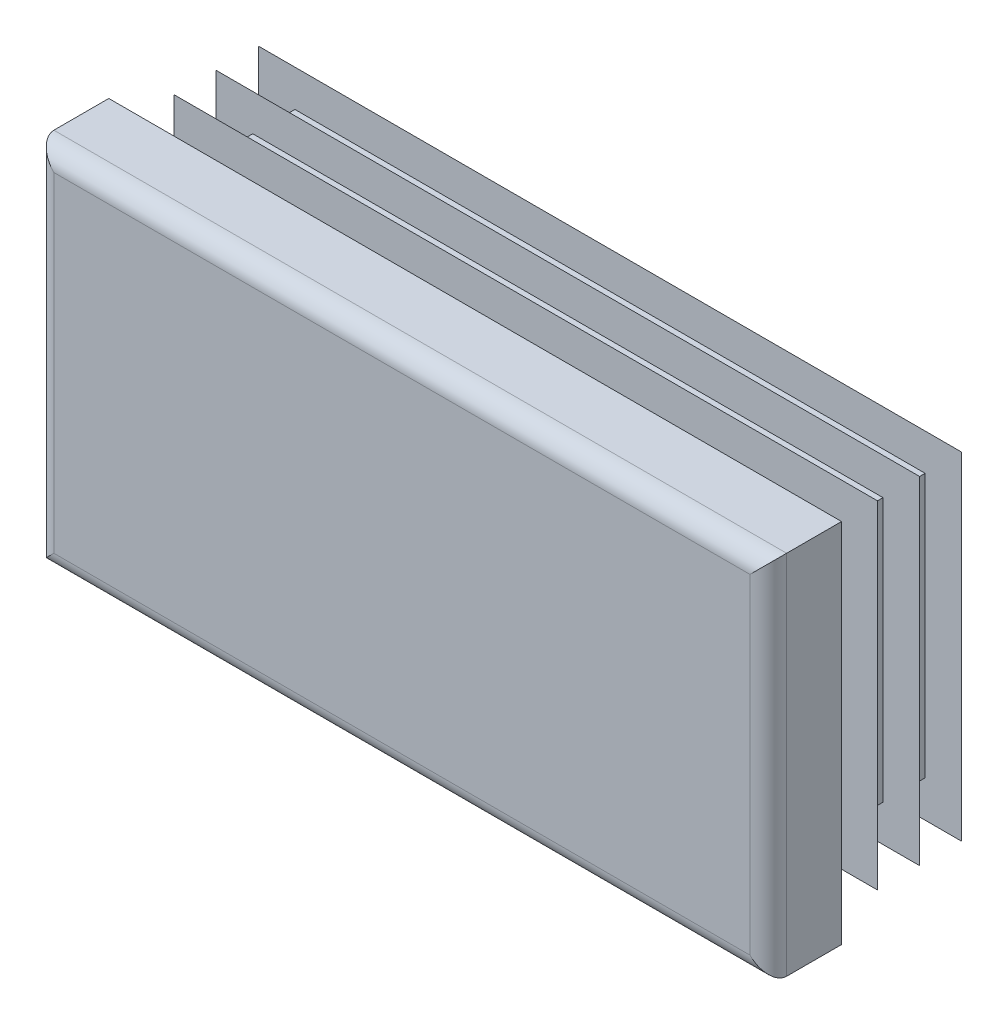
ISO-10303-21;
HEADER;
FILE_DESCRIPTION(('STEP AP214'),'2;1');
FILE_NAME('part.step','',(''),(''),'','','');
FILE_SCHEMA(('AUTOMOTIVE_DESIGN { 1 0 10303 214 1 1 1 1 }'));
ENDSEC;
DATA;
#1=APPLICATION_CONTEXT('core data for automotive mechanical design processes');
#2=APPLICATION_PROTOCOL_DEFINITION('international standard','automotive_design',2000,#1);
#3=PRODUCT_CONTEXT('',#1,'mechanical');
#4=PRODUCT('Part','Part','',(#3));
#5=PRODUCT_RELATED_PRODUCT_CATEGORY('part','',(#4));
#6=PRODUCT_DEFINITION_FORMATION('','',#4);
#7=PRODUCT_DEFINITION_CONTEXT('part definition',#1,'design');
#8=PRODUCT_DEFINITION('design','',#6,#7);
#9=PRODUCT_DEFINITION_SHAPE('','',#8);
#10=(LENGTH_UNIT() NAMED_UNIT(*) SI_UNIT(.MILLI.,.METRE.));
#11=(NAMED_UNIT(*) PLANE_ANGLE_UNIT() SI_UNIT($,.RADIAN.));
#12=(NAMED_UNIT(*) SI_UNIT($,.STERADIAN.) SOLID_ANGLE_UNIT());
#13=UNCERTAINTY_MEASURE_WITH_UNIT(LENGTH_MEASURE(1.E-05),#10,'distance_accuracy_value','');
#14=(GEOMETRIC_REPRESENTATION_CONTEXT(3) GLOBAL_UNCERTAINTY_ASSIGNED_CONTEXT((#13)) GLOBAL_UNIT_ASSIGNED_CONTEXT((#10,
#11,#12)) REPRESENTATION_CONTEXT('',''));
#15=CARTESIAN_POINT('',(0.,0.,0.));
#16=DIRECTION('',(0.,0.,1.));
#17=DIRECTION('',(1.,0.,0.));
#18=AXIS2_PLACEMENT_3D('',#15,#16,#17);
#19=CARTESIAN_POINT('',(23.75,-12.5,5.));
#20=DIRECTION('',(0.,0.,-1.));
#21=DIRECTION('',(0.,1.,0.));
#22=AXIS2_PLACEMENT_3D('',#19,#20,#21);
#23=PLANE('',#22);
#24=DIRECTION('',(0.,1.,0.));
#25=VECTOR('',#24,1.);
#26=CARTESIAN_POINT('',(-23.75,-12.5,5.));
#27=LINE('',#26,#25);
#28=CARTESIAN_POINT('',(-23.75,-11.25,5.));
#29=VERTEX_POINT('',#28);
#30=CARTESIAN_POINT('',(-23.75,11.25,5.));
#31=VERTEX_POINT('',#30);
#32=EDGE_CURVE('E310',#29,#31,#27,.T.);
#33=ORIENTED_EDGE('',*,*,#32,.F.);
#34=DIRECTION('',(-1.,0.,0.));
#35=VECTOR('',#34,1.);
#36=CARTESIAN_POINT('',(25.,-11.25,5.));
#37=LINE('',#36,#35);
#38=CARTESIAN_POINT('',(23.75,-11.25,5.));
#39=VERTEX_POINT('',#38);
#40=EDGE_CURVE('E482',#39,#29,#37,.T.);
#41=ORIENTED_EDGE('',*,*,#40,.F.);
#42=DIRECTION('',(0.,1.,0.));
#43=VECTOR('',#42,1.);
#44=CARTESIAN_POINT('',(23.75,-12.5,5.));
#45=LINE('',#44,#43);
#46=CARTESIAN_POINT('',(23.75,11.25,5.));
#47=VERTEX_POINT('',#46);
#48=EDGE_CURVE('E305',#39,#47,#45,.T.);
#49=ORIENTED_EDGE('',*,*,#48,.T.);
#50=DIRECTION('',(-1.,0.,0.));
#51=VECTOR('',#50,1.);
#52=CARTESIAN_POINT('',(25.,11.25,5.));
#53=LINE('',#52,#51);
#54=EDGE_CURVE('E630',#47,#31,#53,.T.);
#55=ORIENTED_EDGE('',*,*,#54,.T.);
#56=EDGE_LOOP('',(#33,#41,#49,#55));
#57=FACE_BOUND('',#56,.T.);
#58=ADVANCED_FACE('F14',(#57),#23,.F.);
#59=CARTESIAN_POINT('',(-23.75,-12.5,3.75));
#60=DIRECTION('',(0.,1.,0.));
#61=DIRECTION('',(-1.,0.,0.));
#62=AXIS2_PLACEMENT_3D('',#59,#60,#61);
#63=CYLINDRICAL_SURFACE('',#62,1.25);
#64=DIRECTION('',(0.,1.,0.));
#65=VECTOR('',#64,1.);
#66=CARTESIAN_POINT('',(-25.,-12.5,3.75));
#67=LINE('',#66,#65);
#68=CARTESIAN_POINT('',(-25.,-12.5,3.75));
#69=VERTEX_POINT('',#68);
#70=CARTESIAN_POINT('',(-25.,12.5,3.75));
#71=VERTEX_POINT('',#70);
#72=EDGE_CURVE('E402',#69,#71,#67,.T.);
#73=ORIENTED_EDGE('',*,*,#72,.F.);
#74=CARTESIAN_POINT('',(-23.75,-11.25,3.75));
#75=DIRECTION('',(-0.707106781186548,0.707106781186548,0.));
#76=DIRECTION('',(0.707106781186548,0.707106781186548,0.));
#77=AXIS2_PLACEMENT_3D('',#74,#75,#76);
#78=ELLIPSE('',#77,1.76776695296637,1.25);
#79=EDGE_CURVE('E59',#69,#29,#78,.T.);
#80=ORIENTED_EDGE('',*,*,#79,.T.);
#81=ORIENTED_EDGE('',*,*,#32,.T.);
#82=CARTESIAN_POINT('',(-23.75,11.25,3.75));
#83=DIRECTION('',(0.707106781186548,0.707106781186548,0.));
#84=DIRECTION('',(-0.707106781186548,0.707106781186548,0.));
#85=AXIS2_PLACEMENT_3D('',#82,#83,#84);
#86=ELLIPSE('',#85,1.76776695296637,1.25);
#87=EDGE_CURVE('E306',#31,#71,#86,.F.);
#88=ORIENTED_EDGE('',*,*,#87,.T.);
#89=EDGE_LOOP('',(#73,#80,#81,#88));
#90=FACE_BOUND('',#89,.T.);
#91=ADVANCED_FACE('F16',(#90),#63,.T.);
#92=CARTESIAN_POINT('',(-25.,-12.5,3.75));
#93=DIRECTION('',(1.,0.,0.));
#94=DIRECTION('',(0.,1.,0.));
#95=AXIS2_PLACEMENT_3D('',#92,#93,#94);
#96=PLANE('',#95);
#97=DIRECTION('',(0.,0.,-1.));
#98=VECTOR('',#97,1.);
#99=CARTESIAN_POINT('',(-25.,12.5,3.75));
#100=LINE('',#99,#98);
#101=CARTESIAN_POINT('',(-25.,12.5,0.));
#102=VERTEX_POINT('',#101);
#103=EDGE_CURVE('E615',#71,#102,#100,.T.);
#104=ORIENTED_EDGE('',*,*,#103,.T.);
#105=DIRECTION('',(0.,1.,0.));
#106=VECTOR('',#105,1.);
#107=CARTESIAN_POINT('',(-25.,-12.5,0.));
#108=LINE('',#107,#106);
#109=CARTESIAN_POINT('',(-25.,-12.5,0.));
#110=VERTEX_POINT('',#109);
#111=EDGE_CURVE('E400',#110,#102,#108,.T.);
#112=ORIENTED_EDGE('',*,*,#111,.F.);
#113=DIRECTION('',(0.,0.,-1.));
#114=VECTOR('',#113,1.);
#115=CARTESIAN_POINT('',(-25.,-12.5,3.75));
#116=LINE('',#115,#114);
#117=EDGE_CURVE('E616',#69,#110,#116,.T.);
#118=ORIENTED_EDGE('',*,*,#117,.F.);
#119=ORIENTED_EDGE('',*,*,#72,.T.);
#120=EDGE_LOOP('',(#104,#112,#118,#119));
#121=FACE_BOUND('',#120,.T.);
#122=ADVANCED_FACE('F697',(#121),#96,.F.);
#123=CARTESIAN_POINT('',(-21.5,-12.5,0.));
#124=DIRECTION('',(1.,0.,0.));
#125=DIRECTION('',(0.,1.,0.));
#126=AXIS2_PLACEMENT_3D('',#123,#124,#125);
#127=PLANE('',#126);
#128=DIRECTION('',(0.,1.,0.));
#129=VECTOR('',#128,1.);
#130=CARTESIAN_POINT('',(-21.5,-12.5,0.));
#131=LINE('',#130,#129);
#132=CARTESIAN_POINT('',(-21.5,-9.,0.));
#133=VERTEX_POINT('',#132);
#134=CARTESIAN_POINT('',(-21.5,9.,0.));
#135=VERTEX_POINT('',#134);
#136=EDGE_CURVE('E397',#133,#135,#131,.T.);
#137=ORIENTED_EDGE('',*,*,#136,.T.);
#138=DIRECTION('',(0.,0.,-1.));
#139=VECTOR('',#138,1.);
#140=CARTESIAN_POINT('',(-21.5,9.,0.));
#141=LINE('',#140,#139);
#142=CARTESIAN_POINT('',(-21.5,9.,-0.575));
#143=VERTEX_POINT('',#142);
#144=EDGE_CURVE('E495',#135,#143,#141,.T.);
#145=ORIENTED_EDGE('',*,*,#144,.T.);
#146=DIRECTION('',(0.,1.,0.));
#147=VECTOR('',#146,1.);
#148=CARTESIAN_POINT('',(-21.5,-12.5,-0.575));
#149=LINE('',#148,#147);
#150=CARTESIAN_POINT('',(-21.5,-9.,-0.575));
#151=VERTEX_POINT('',#150);
#152=EDGE_CURVE('E394',#151,#143,#149,.T.);
#153=ORIENTED_EDGE('',*,*,#152,.F.);
#154=DIRECTION('',(0.,0.,1.));
#155=VECTOR('',#154,1.);
#156=CARTESIAN_POINT('',(-21.5,-9.,0.));
#157=LINE('',#156,#155);
#158=EDGE_CURVE('E489',#151,#133,#157,.T.);
#159=ORIENTED_EDGE('',*,*,#158,.T.);
#160=EDGE_LOOP('',(#137,#145,#153,#159));
#161=FACE_BOUND('',#160,.T.);
#162=ADVANCED_FACE('F787',(#161),#127,.F.);
#163=CARTESIAN_POINT('',(-24.,-12.5,-0.575));
#164=DIRECTION('',(0.342020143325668,0.,0.939692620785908));
#165=DIRECTION('',(-0.939692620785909,0.,0.342020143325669));
#166=AXIS2_PLACEMENT_3D('',#163,#164,#165);
#167=PLANE('',#166);
#168=DIRECTION('',(0.,1.,0.));
#169=VECTOR('',#168,1.);
#170=CARTESIAN_POINT('',(-24.,-12.5,-0.575));
#171=LINE('',#170,#169);
#172=CARTESIAN_POINT('',(-24.,-11.5,-0.575));
#173=VERTEX_POINT('',#172);
#174=CARTESIAN_POINT('',(-24.,11.5,-0.575));
#175=VERTEX_POINT('',#174);
#176=EDGE_CURVE('E392',#173,#175,#171,.T.);
#177=ORIENTED_EDGE('',*,*,#176,.T.);
#178=DIRECTION('',(0.844349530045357,-0.438895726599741,-0.307318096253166));
#179=VECTOR('',#178,1.);
#180=CARTESIAN_POINT('',(-15.1060463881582,6.87689298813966,-3.81213437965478));
#181=LINE('',#180,#179);
#182=CARTESIAN_POINT('',(-21.5,10.2004915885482,-1.48492558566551));
#183=VERTEX_POINT('',#182);
#184=EDGE_CURVE('E519',#175,#183,#181,.T.);
#185=ORIENTED_EDGE('',*,*,#184,.T.);
#186=DIRECTION('',(0.,1.,0.));
#187=VECTOR('',#186,1.);
#188=CARTESIAN_POINT('',(-21.5,-12.5,-1.48492558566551));
#189=LINE('',#188,#187);
#190=CARTESIAN_POINT('',(-21.5,-10.2004915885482,-1.48492558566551));
#191=VERTEX_POINT('',#190);
#192=EDGE_CURVE('E389',#191,#183,#189,.T.);
#193=ORIENTED_EDGE('',*,*,#192,.F.);
#194=DIRECTION('',(-0.844349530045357,-0.43889572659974,0.307318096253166));
#195=VECTOR('',#194,1.);
#196=CARTESIAN_POINT('',(-24.3705814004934,-11.6926294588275,-0.440119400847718));
#197=LINE('',#196,#195);
#198=EDGE_CURVE('E507',#191,#173,#197,.T.);
#199=ORIENTED_EDGE('',*,*,#198,.T.);
#200=EDGE_LOOP('',(#177,#185,#193,#199));
#201=FACE_BOUND('',#200,.T.);
#202=ADVANCED_FACE('F783',(#201),#167,.F.);
#203=CARTESIAN_POINT('',(-21.5,-12.5,-1.48492558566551));
#204=DIRECTION('',(1.,0.,0.));
#205=DIRECTION('',(0.,1.,0.));
#206=AXIS2_PLACEMENT_3D('',#203,#204,#205);
#207=PLANE('',#206);
#208=ORIENTED_EDGE('',*,*,#192,.T.);
#209=DIRECTION('',(0.,-0.819152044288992,-0.573576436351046));
#210=VECTOR('',#209,1.);
#211=CARTESIAN_POINT('',(-21.5,-5.03176689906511,-12.1506678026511));
#212=LINE('',#211,#210);
#213=CARTESIAN_POINT('',(-21.5,9.,-2.32551884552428));
#214=VERTEX_POINT('',#213);
#215=EDGE_CURVE('E516',#183,#214,#212,.T.);
#216=ORIENTED_EDGE('',*,*,#215,.T.);
#217=DIRECTION('',(0.,0.,-1.));
#218=VECTOR('',#217,1.);
#219=CARTESIAN_POINT('',(-21.5,9.,-1.48492558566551));
#220=LINE('',#219,#218);
#221=CARTESIAN_POINT('',(-21.5,9.,-3.45));
#222=VERTEX_POINT('',#221);
#223=EDGE_CURVE('E525',#214,#222,#220,.T.);
#224=ORIENTED_EDGE('',*,*,#223,.T.);
#225=DIRECTION('',(0.,1.,0.));
#226=VECTOR('',#225,1.);
#227=CARTESIAN_POINT('',(-21.5,-12.5,-3.45));
#228=LINE('',#227,#226);
#229=CARTESIAN_POINT('',(-21.5,-9.,-3.45));
#230=VERTEX_POINT('',#229);
#231=EDGE_CURVE('E386',#230,#222,#228,.T.);
#232=ORIENTED_EDGE('',*,*,#231,.F.);
#233=DIRECTION('',(0.,0.,1.));
#234=VECTOR('',#233,1.);
#235=CARTESIAN_POINT('',(-21.5,-9.,-1.48492558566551));
#236=LINE('',#235,#234);
#237=CARTESIAN_POINT('',(-21.5,-9.,-2.32551884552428));
#238=VERTEX_POINT('',#237);
#239=EDGE_CURVE('E522',#230,#238,#236,.T.);
#240=ORIENTED_EDGE('',*,*,#239,.T.);
#241=DIRECTION('',(0.,-0.819152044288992,0.573576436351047));
#242=VECTOR('',#241,1.);
#243=CARTESIAN_POINT('',(-21.5,-11.7434848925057,-0.404510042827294));
#244=LINE('',#243,#242);
#245=EDGE_CURVE('E504',#238,#191,#244,.T.);
#246=ORIENTED_EDGE('',*,*,#245,.T.);
#247=EDGE_LOOP('',(#208,#216,#224,#232,#240,#246));
#248=FACE_BOUND('',#247,.T.);
#249=ADVANCED_FACE('F779',(#248),#207,.F.);
#250=CARTESIAN_POINT('',(-24.,-12.5,-3.45));
#251=DIRECTION('',(0.342020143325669,0.,0.939692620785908));
#252=DIRECTION('',(-0.939692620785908,0.,0.342020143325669));
#253=AXIS2_PLACEMENT_3D('',#250,#251,#252);
#254=PLANE('',#253);
#255=DIRECTION('',(0.,1.,0.));
#256=VECTOR('',#255,1.);
#257=CARTESIAN_POINT('',(-24.,-12.5,-3.45));
#258=LINE('',#257,#256);
#259=CARTESIAN_POINT('',(-24.,-11.5,-3.45));
#260=VERTEX_POINT('',#259);
#261=CARTESIAN_POINT('',(-24.,11.5,-3.45));
#262=VERTEX_POINT('',#261);
#263=EDGE_CURVE('E384',#260,#262,#258,.T.);
#264=ORIENTED_EDGE('',*,*,#263,.T.);
#265=DIRECTION('',(0.844349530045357,-0.438895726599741,-0.307318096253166));
#266=VECTOR('',#265,1.);
#267=CARTESIAN_POINT('',(-15.1060463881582,6.87689298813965,-6.68713437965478));
#268=LINE('',#267,#266);
#269=CARTESIAN_POINT('',(-21.5,10.2004915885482,-4.35992558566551));
#270=VERTEX_POINT('',#269);
#271=EDGE_CURVE('E549',#262,#270,#268,.T.);
#272=ORIENTED_EDGE('',*,*,#271,.T.);
#273=DIRECTION('',(0.,1.,0.));
#274=VECTOR('',#273,1.);
#275=CARTESIAN_POINT('',(-21.5,-12.5,-4.35992558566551));
#276=LINE('',#275,#274);
#277=CARTESIAN_POINT('',(-21.5,-10.2004915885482,-4.35992558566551));
#278=VERTEX_POINT('',#277);
#279=EDGE_CURVE('E381',#278,#270,#276,.T.);
#280=ORIENTED_EDGE('',*,*,#279,.F.);
#281=DIRECTION('',(-0.844349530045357,-0.43889572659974,0.307318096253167));
#282=VECTOR('',#281,1.);
#283=CARTESIAN_POINT('',(-24.3705814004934,-11.6926294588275,-3.31511940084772));
#284=LINE('',#283,#282);
#285=EDGE_CURVE('E537',#278,#260,#284,.T.);
#286=ORIENTED_EDGE('',*,*,#285,.T.);
#287=EDGE_LOOP('',(#264,#272,#280,#286));
#288=FACE_BOUND('',#287,.T.);
#289=ADVANCED_FACE('F775',(#288),#254,.F.);
#290=CARTESIAN_POINT('',(-21.5,-12.5,-4.35992558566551));
#291=DIRECTION('',(1.,0.,0.));
#292=DIRECTION('',(0.,1.,0.));
#293=AXIS2_PLACEMENT_3D('',#290,#291,#292);
#294=PLANE('',#293);
#295=ORIENTED_EDGE('',*,*,#279,.T.);
#296=DIRECTION('',(0.,-0.819152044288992,-0.573576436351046));
#297=VECTOR('',#296,1.);
#298=CARTESIAN_POINT('',(-21.5,-5.03176689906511,-15.0256678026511));
#299=LINE('',#298,#297);
#300=CARTESIAN_POINT('',(-21.5,9.,-5.20051884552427));
#301=VERTEX_POINT('',#300);
#302=EDGE_CURVE('E546',#270,#301,#299,.T.);
#303=ORIENTED_EDGE('',*,*,#302,.T.);
#304=DIRECTION('',(0.,0.,-1.));
#305=VECTOR('',#304,1.);
#306=CARTESIAN_POINT('',(-21.5,9.,-4.35992558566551));
#307=LINE('',#306,#305);
#308=CARTESIAN_POINT('',(-21.5,9.,-6.325));
#309=VERTEX_POINT('',#308);
#310=EDGE_CURVE('E555',#301,#309,#307,.T.);
#311=ORIENTED_EDGE('',*,*,#310,.T.);
#312=DIRECTION('',(0.,1.,0.));
#313=VECTOR('',#312,1.);
#314=CARTESIAN_POINT('',(-21.5,-12.5,-6.325));
#315=LINE('',#314,#313);
#316=CARTESIAN_POINT('',(-21.5,-9.,-6.325));
#317=VERTEX_POINT('',#316);
#318=EDGE_CURVE('E378',#317,#309,#315,.T.);
#319=ORIENTED_EDGE('',*,*,#318,.F.);
#320=DIRECTION('',(0.,0.,1.));
#321=VECTOR('',#320,1.);
#322=CARTESIAN_POINT('',(-21.5,-9.,-4.35992558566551));
#323=LINE('',#322,#321);
#324=CARTESIAN_POINT('',(-21.5,-9.,-5.20051884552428));
#325=VERTEX_POINT('',#324);
#326=EDGE_CURVE('E552',#317,#325,#323,.T.);
#327=ORIENTED_EDGE('',*,*,#326,.T.);
#328=DIRECTION('',(0.,-0.819152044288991,0.573576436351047));
#329=VECTOR('',#328,1.);
#330=CARTESIAN_POINT('',(-21.5,-11.7434848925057,-3.27951004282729));
#331=LINE('',#330,#329);
#332=EDGE_CURVE('E534',#325,#278,#331,.T.);
#333=ORIENTED_EDGE('',*,*,#332,.T.);
#334=EDGE_LOOP('',(#295,#303,#311,#319,#327,#333));
#335=FACE_BOUND('',#334,.T.);
#336=ADVANCED_FACE('F771',(#335),#294,.F.);
#337=CARTESIAN_POINT('',(-24.,-12.5,-6.325));
#338=DIRECTION('',(0.34202014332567,0.,0.939692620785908));
#339=DIRECTION('',(-0.939692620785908,0.,0.34202014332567));
#340=AXIS2_PLACEMENT_3D('',#337,#338,#339);
#341=PLANE('',#340);
#342=DIRECTION('',(0.,1.,0.));
#343=VECTOR('',#342,1.);
#344=CARTESIAN_POINT('',(-24.,-12.5,-6.325));
#345=LINE('',#344,#343);
#346=CARTESIAN_POINT('',(-24.,-11.5,-6.325));
#347=VERTEX_POINT('',#346);
#348=CARTESIAN_POINT('',(-24.,11.5,-6.325));
#349=VERTEX_POINT('',#348);
#350=EDGE_CURVE('E376',#347,#349,#345,.T.);
#351=ORIENTED_EDGE('',*,*,#350,.T.);
#352=DIRECTION('',(0.844349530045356,-0.438895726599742,-0.307318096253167));
#353=VECTOR('',#352,1.);
#354=CARTESIAN_POINT('',(-15.1060463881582,6.87689298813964,-9.5621343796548));
#355=LINE('',#354,#353);
#356=CARTESIAN_POINT('',(-21.5,10.2004915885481,-7.23492558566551));
#357=VERTEX_POINT('',#356);
#358=EDGE_CURVE('E579',#349,#357,#355,.T.);
#359=ORIENTED_EDGE('',*,*,#358,.T.);
#360=DIRECTION('',(0.,1.,0.));
#361=VECTOR('',#360,1.);
#362=CARTESIAN_POINT('',(-21.5,-12.5,-7.23492558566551));
#363=LINE('',#362,#361);
#364=CARTESIAN_POINT('',(-21.5,-10.2004915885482,-7.23492558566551));
#365=VERTEX_POINT('',#364);
#366=EDGE_CURVE('E373',#365,#357,#363,.T.);
#367=ORIENTED_EDGE('',*,*,#366,.F.);
#368=DIRECTION('',(-0.844349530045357,-0.438895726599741,0.307318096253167));
#369=VECTOR('',#368,1.);
#370=CARTESIAN_POINT('',(-24.3705814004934,-11.6926294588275,-6.19011940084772));
#371=LINE('',#370,#369);
#372=EDGE_CURVE('E567',#365,#347,#371,.T.);
#373=ORIENTED_EDGE('',*,*,#372,.T.);
#374=EDGE_LOOP('',(#351,#359,#367,#373));
#375=FACE_BOUND('',#374,.T.);
#376=ADVANCED_FACE('F767',(#375),#341,.F.);
#377=CARTESIAN_POINT('',(-21.5,-12.5,-7.23492558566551));
#378=DIRECTION('',(1.,0.,0.));
#379=DIRECTION('',(0.,1.,0.));
#380=AXIS2_PLACEMENT_3D('',#377,#378,#379);
#381=PLANE('',#380);
#382=ORIENTED_EDGE('',*,*,#366,.T.);
#383=DIRECTION('',(0.,-0.819152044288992,-0.573576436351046));
#384=VECTOR('',#383,1.);
#385=CARTESIAN_POINT('',(-21.5,-5.0317668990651,-17.9006678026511));
#386=LINE('',#385,#384);
#387=CARTESIAN_POINT('',(-21.5,9.,-8.07551884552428));
#388=VERTEX_POINT('',#387);
#389=EDGE_CURVE('E576',#357,#388,#386,.T.);
#390=ORIENTED_EDGE('',*,*,#389,.T.);
#391=DIRECTION('',(0.,0.,-1.));
#392=VECTOR('',#391,1.);
#393=CARTESIAN_POINT('',(-21.5,9.,-7.23492558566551));
#394=LINE('',#393,#392);
#395=CARTESIAN_POINT('',(-21.5,9.,-9.2));
#396=VERTEX_POINT('',#395);
#397=EDGE_CURVE('E585',#388,#396,#394,.T.);
#398=ORIENTED_EDGE('',*,*,#397,.T.);
#399=DIRECTION('',(0.,1.,0.));
#400=VECTOR('',#399,1.);
#401=CARTESIAN_POINT('',(-21.5,-12.5,-9.2));
#402=LINE('',#401,#400);
#403=CARTESIAN_POINT('',(-21.5,-9.,-9.2));
#404=VERTEX_POINT('',#403);
#405=EDGE_CURVE('E370',#404,#396,#402,.T.);
#406=ORIENTED_EDGE('',*,*,#405,.F.);
#407=DIRECTION('',(0.,0.,1.));
#408=VECTOR('',#407,1.);
#409=CARTESIAN_POINT('',(-21.5,-9.,-7.23492558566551));
#410=LINE('',#409,#408);
#411=CARTESIAN_POINT('',(-21.5,-9.,-8.07551884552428));
#412=VERTEX_POINT('',#411);
#413=EDGE_CURVE('E582',#404,#412,#410,.T.);
#414=ORIENTED_EDGE('',*,*,#413,.T.);
#415=DIRECTION('',(0.,-0.819152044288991,0.573576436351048));
#416=VECTOR('',#415,1.);
#417=CARTESIAN_POINT('',(-21.5,-11.7434848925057,-6.1545100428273));
#418=LINE('',#417,#416);
#419=EDGE_CURVE('E564',#412,#365,#418,.T.);
#420=ORIENTED_EDGE('',*,*,#419,.T.);
#421=EDGE_LOOP('',(#382,#390,#398,#406,#414,#420));
#422=FACE_BOUND('',#421,.T.);
#423=ADVANCED_FACE('F764',(#422),#381,.F.);
#424=CARTESIAN_POINT('',(-24.,-12.5,-9.2));
#425=DIRECTION('',(0.342020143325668,0.,0.939692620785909));
#426=DIRECTION('',(-0.939692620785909,0.,0.342020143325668));
#427=AXIS2_PLACEMENT_3D('',#424,#425,#426);
#428=PLANE('',#427);
#429=DIRECTION('',(0.,1.,0.));
#430=VECTOR('',#429,1.);
#431=CARTESIAN_POINT('',(-24.,-12.5,-9.2));
#432=LINE('',#431,#430);
#433=CARTESIAN_POINT('',(-24.,-11.5,-9.2));
#434=VERTEX_POINT('',#433);
#435=CARTESIAN_POINT('',(-24.,11.5,-9.2));
#436=VERTEX_POINT('',#435);
#437=EDGE_CURVE('E368',#434,#436,#432,.T.);
#438=ORIENTED_EDGE('',*,*,#437,.T.);
#439=DIRECTION('',(0.844349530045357,-0.438895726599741,-0.307318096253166));
#440=VECTOR('',#439,1.);
#441=CARTESIAN_POINT('',(-15.1060463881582,6.87689298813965,-12.4371343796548));
#442=LINE('',#441,#440);
#443=CARTESIAN_POINT('',(-21.5,10.2004915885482,-10.1099255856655));
#444=VERTEX_POINT('',#443);
#445=EDGE_CURVE('E607',#436,#444,#442,.T.);
#446=ORIENTED_EDGE('',*,*,#445,.T.);
#447=DIRECTION('',(0.,1.,0.));
#448=VECTOR('',#447,1.);
#449=CARTESIAN_POINT('',(-21.5,-12.5,-10.1099255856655));
#450=LINE('',#449,#448);
#451=CARTESIAN_POINT('',(-21.5,-10.2004915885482,-10.1099255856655));
#452=VERTEX_POINT('',#451);
#453=EDGE_CURVE('E365',#452,#444,#450,.T.);
#454=ORIENTED_EDGE('',*,*,#453,.F.);
#455=DIRECTION('',(-0.844349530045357,-0.43889572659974,0.307318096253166));
#456=VECTOR('',#455,1.);
#457=CARTESIAN_POINT('',(-24.3705814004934,-11.6926294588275,-9.06511940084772));
#458=LINE('',#457,#456);
#459=EDGE_CURVE('E595',#452,#434,#458,.T.);
#460=ORIENTED_EDGE('',*,*,#459,.T.);
#461=EDGE_LOOP('',(#438,#446,#454,#460));
#462=FACE_BOUND('',#461,.T.);
#463=ADVANCED_FACE('F675',(#462),#428,.F.);
#464=CARTESIAN_POINT('',(-21.5,-12.5,-10.1099255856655));
#465=DIRECTION('',(1.,0.,0.));
#466=DIRECTION('',(0.,1.,0.));
#467=AXIS2_PLACEMENT_3D('',#464,#465,#466);
#468=PLANE('',#467);
#469=ORIENTED_EDGE('',*,*,#453,.T.);
#470=DIRECTION('',(0.,-0.819152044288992,-0.573576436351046));
#471=VECTOR('',#470,1.);
#472=CARTESIAN_POINT('',(-21.5,-5.03176689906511,-20.7756678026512));
#473=LINE('',#472,#471);
#474=CARTESIAN_POINT('',(-21.5,9.,-10.9505188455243));
#475=VERTEX_POINT('',#474);
#476=EDGE_CURVE('E604',#444,#475,#473,.T.);
#477=ORIENTED_EDGE('',*,*,#476,.T.);
#478=DIRECTION('',(0.,0.,-1.));
#479=VECTOR('',#478,1.);
#480=CARTESIAN_POINT('',(-21.5,9.,-10.1099255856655));
#481=LINE('',#480,#479);
#482=CARTESIAN_POINT('',(-21.5,9.,-11.5));
#483=VERTEX_POINT('',#482);
#484=EDGE_CURVE('E613',#475,#483,#481,.T.);
#485=ORIENTED_EDGE('',*,*,#484,.T.);
#486=DIRECTION('',(0.,1.,0.));
#487=VECTOR('',#486,1.);
#488=CARTESIAN_POINT('',(-21.5,-12.5,-11.5));
#489=LINE('',#488,#487);
#490=CARTESIAN_POINT('',(-21.5,-9.,-11.5));
#491=VERTEX_POINT('',#490);
#492=EDGE_CURVE('E362',#491,#483,#489,.T.);
#493=ORIENTED_EDGE('',*,*,#492,.F.);
#494=DIRECTION('',(0.,0.,1.));
#495=VECTOR('',#494,1.);
#496=CARTESIAN_POINT('',(-21.5,-9.,-10.1099255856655));
#497=LINE('',#496,#495);
#498=CARTESIAN_POINT('',(-21.5,-9.,-10.9505188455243));
#499=VERTEX_POINT('',#498);
#500=EDGE_CURVE('E610',#491,#499,#497,.T.);
#501=ORIENTED_EDGE('',*,*,#500,.T.);
#502=DIRECTION('',(0.,-0.819152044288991,0.573576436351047));
#503=VECTOR('',#502,1.);
#504=CARTESIAN_POINT('',(-21.5,-11.7434848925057,-9.02951004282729));
#505=LINE('',#504,#503);
#506=EDGE_CURVE('E592',#499,#452,#505,.T.);
#507=ORIENTED_EDGE('',*,*,#506,.T.);
#508=EDGE_LOOP('',(#469,#477,#485,#493,#501,#507));
#509=FACE_BOUND('',#508,.T.);
#510=ADVANCED_FACE('F677',(#509),#468,.F.);
#511=CARTESIAN_POINT('',(-21.5,-12.5,-11.5));
#512=DIRECTION('',(0.,0.,1.));
#513=DIRECTION('',(0.,-1.,0.));
#514=AXIS2_PLACEMENT_3D('',#511,#512,#513);
#515=PLANE('',#514);
#516=ORIENTED_EDGE('',*,*,#492,.T.);
#517=DIRECTION('',(-1.,0.,0.));
#518=VECTOR('',#517,1.);
#519=CARTESIAN_POINT('',(25.,9.,-11.5));
#520=LINE('',#519,#518);
#521=CARTESIAN_POINT('',(21.5,9.,-11.5));
#522=VERTEX_POINT('',#521);
#523=EDGE_CURVE('E438',#522,#483,#520,.T.);
#524=ORIENTED_EDGE('',*,*,#523,.F.);
#525=DIRECTION('',(0.,1.,0.));
#526=VECTOR('',#525,1.);
#527=CARTESIAN_POINT('',(21.5,-12.5,-11.5));
#528=LINE('',#527,#526);
#529=CARTESIAN_POINT('',(21.5,-9.,-11.5));
#530=VERTEX_POINT('',#529);
#531=EDGE_CURVE('E359',#530,#522,#528,.T.);
#532=ORIENTED_EDGE('',*,*,#531,.F.);
#533=DIRECTION('',(-1.,0.,0.));
#534=VECTOR('',#533,1.);
#535=CARTESIAN_POINT('',(25.,-9.,-11.5));
#536=LINE('',#535,#534);
#537=EDGE_CURVE('E436',#530,#491,#536,.T.);
#538=ORIENTED_EDGE('',*,*,#537,.T.);
#539=EDGE_LOOP('',(#516,#524,#532,#538));
#540=FACE_BOUND('',#539,.T.);
#541=ADVANCED_FACE('F435',(#540),#515,.F.);
#542=CARTESIAN_POINT('',(21.5,-12.5,-11.5));
#543=DIRECTION('',(-1.,0.,0.));
#544=DIRECTION('',(0.,-1.,0.));
#545=AXIS2_PLACEMENT_3D('',#542,#543,#544);
#546=PLANE('',#545);
#547=DIRECTION('',(0.,0.,1.));
#548=VECTOR('',#547,1.);
#549=CARTESIAN_POINT('',(21.5,9.,-11.5));
#550=LINE('',#549,#548);
#551=CARTESIAN_POINT('',(21.5,9.,-10.9505188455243));
#552=VERTEX_POINT('',#551);
#553=EDGE_CURVE('E9',#522,#552,#550,.T.);
#554=ORIENTED_EDGE('',*,*,#553,.T.);
#555=DIRECTION('',(0.,0.819152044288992,0.573576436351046));
#556=VECTOR('',#555,1.);
#557=CARTESIAN_POINT('',(21.5,-5.68488823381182,-21.2329882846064));
#558=LINE('',#557,#556);
#559=CARTESIAN_POINT('',(21.5,10.2004915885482,-10.1099255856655));
#560=VERTEX_POINT('',#559);
#561=EDGE_CURVE('E601',#552,#560,#558,.T.);
#562=ORIENTED_EDGE('',*,*,#561,.T.);
#563=DIRECTION('',(0.,1.,0.));
#564=VECTOR('',#563,1.);
#565=CARTESIAN_POINT('',(21.5,-12.5,-10.1099255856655));
#566=LINE('',#565,#564);
#567=CARTESIAN_POINT('',(21.5,-10.2004915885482,-10.1099255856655));
#568=VERTEX_POINT('',#567);
#569=EDGE_CURVE('E356',#568,#560,#566,.T.);
#570=ORIENTED_EDGE('',*,*,#569,.F.);
#571=DIRECTION('',(0.,0.819152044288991,-0.573576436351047));
#572=VECTOR('',#571,1.);
#573=CARTESIAN_POINT('',(21.5,-11.090363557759,-9.48683052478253));
#574=LINE('',#573,#572);
#575=CARTESIAN_POINT('',(21.5,-9.,-10.9505188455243));
#576=VERTEX_POINT('',#575);
#577=EDGE_CURVE('E428',#568,#576,#574,.T.);
#578=ORIENTED_EDGE('',*,*,#577,.T.);
#579=DIRECTION('',(0.,0.,-1.));
#580=VECTOR('',#579,1.);
#581=CARTESIAN_POINT('',(21.5,-9.,-11.5));
#582=LINE('',#581,#580);
#583=EDGE_CURVE('E23',#576,#530,#582,.T.);
#584=ORIENTED_EDGE('',*,*,#583,.T.);
#585=ORIENTED_EDGE('',*,*,#531,.T.);
#586=EDGE_LOOP('',(#554,#562,#570,#578,#584,#585));
#587=FACE_BOUND('',#586,.T.);
#588=ADVANCED_FACE('F426',(#587),#546,.F.);
#589=CARTESIAN_POINT('',(21.5,-12.5,-10.1099255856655));
#590=DIRECTION('',(-0.342020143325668,0.,0.939692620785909));
#591=DIRECTION('',(-0.939692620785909,0.,-0.342020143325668));
#592=AXIS2_PLACEMENT_3D('',#589,#590,#591);
#593=PLANE('',#592);
#594=ORIENTED_EDGE('',*,*,#569,.T.);
#595=DIRECTION('',(0.844349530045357,0.438895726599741,0.307318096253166));
#596=VECTOR('',#595,1.);
#597=CARTESIAN_POINT('',(13.087620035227,5.82770817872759,-13.1717814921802));
#598=LINE('',#597,#596);
#599=CARTESIAN_POINT('',(24.,11.5,-9.2));
#600=VERTEX_POINT('',#599);
#601=EDGE_CURVE('E598',#560,#600,#598,.T.);
#602=ORIENTED_EDGE('',*,*,#601,.T.);
#603=DIRECTION('',(0.,1.,0.));
#604=VECTOR('',#603,1.);
#605=CARTESIAN_POINT('',(24.,-12.5,-9.2));
#606=LINE('',#605,#604);
#607=CARTESIAN_POINT('',(24.,-11.5,-9.2));
#608=VERTEX_POINT('',#607);
#609=EDGE_CURVE('E353',#608,#600,#606,.T.);
#610=ORIENTED_EDGE('',*,*,#609,.F.);
#611=DIRECTION('',(-0.844349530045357,0.43889572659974,-0.307318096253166));
#612=VECTOR('',#611,1.);
#613=CARTESIAN_POINT('',(22.3521550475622,-10.6434446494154,-9.79976651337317));
#614=LINE('',#613,#612);
#615=EDGE_CURVE('E588',#608,#568,#614,.T.);
#616=ORIENTED_EDGE('',*,*,#615,.T.);
#617=EDGE_LOOP('',(#594,#602,#610,#616));
#618=FACE_BOUND('',#617,.T.);
#619=ADVANCED_FACE('F752',(#618),#593,.F.);
#620=CARTESIAN_POINT('',(24.,-12.5,-9.2));
#621=DIRECTION('',(0.,0.,-1.));
#622=DIRECTION('',(0.,1.,0.));
#623=AXIS2_PLACEMENT_3D('',#620,#621,#622);
#624=PLANE('',#623);
#625=ORIENTED_EDGE('',*,*,#609,.T.);
#626=DIRECTION('',(-1.,0.,0.));
#627=VECTOR('',#626,1.);
#628=CARTESIAN_POINT('',(25.,11.5,-9.2));
#629=LINE('',#628,#627);
#630=EDGE_CURVE('E444',#600,#436,#629,.T.);
#631=ORIENTED_EDGE('',*,*,#630,.T.);
#632=ORIENTED_EDGE('',*,*,#437,.F.);
#633=DIRECTION('',(-1.,0.,0.));
#634=VECTOR('',#633,1.);
#635=CARTESIAN_POINT('',(25.,-11.5,-9.2));
#636=LINE('',#635,#634);
#637=EDGE_CURVE('E451',#608,#434,#636,.T.);
#638=ORIENTED_EDGE('',*,*,#637,.F.);
#639=EDGE_LOOP('',(#625,#631,#632,#638));
#640=FACE_BOUND('',#639,.T.);
#641=ORIENTED_EDGE('',*,*,#405,.T.);
#642=DIRECTION('',(-1.,0.,0.));
#643=VECTOR('',#642,1.);
#644=CARTESIAN_POINT('',(25.,9.,-9.2));
#645=LINE('',#644,#643);
#646=CARTESIAN_POINT('',(21.5,9.,-9.2));
#647=VERTEX_POINT('',#646);
#648=EDGE_CURVE('E663',#647,#396,#645,.T.);
#649=ORIENTED_EDGE('',*,*,#648,.F.);
#650=DIRECTION('',(0.,1.,0.));
#651=VECTOR('',#650,1.);
#652=CARTESIAN_POINT('',(21.5,-12.5,-9.2));
#653=LINE('',#652,#651);
#654=CARTESIAN_POINT('',(21.5,-9.,-9.2));
#655=VERTEX_POINT('',#654);
#656=EDGE_CURVE('E350',#655,#647,#653,.T.);
#657=ORIENTED_EDGE('',*,*,#656,.F.);
#658=DIRECTION('',(-1.,0.,0.));
#659=VECTOR('',#658,1.);
#660=CARTESIAN_POINT('',(25.,-9.,-9.2));
#661=LINE('',#660,#659);
#662=EDGE_CURVE('E453',#655,#404,#661,.T.);
#663=ORIENTED_EDGE('',*,*,#662,.T.);
#664=EDGE_LOOP('',(#641,#649,#657,#663));
#665=FACE_BOUND('',#664,.T.);
#666=ADVANCED_FACE('F667',(#640,#665),#624,.F.);
#667=CARTESIAN_POINT('',(21.5,-12.5,-9.2));
#668=DIRECTION('',(-1.,0.,0.));
#669=DIRECTION('',(0.,-1.,0.));
#670=AXIS2_PLACEMENT_3D('',#667,#668,#669);
#671=PLANE('',#670);
#672=DIRECTION('',(0.,0.,1.));
#673=VECTOR('',#672,1.);
#674=CARTESIAN_POINT('',(21.5,9.,-9.2));
#675=LINE('',#674,#673);
#676=CARTESIAN_POINT('',(21.5,9.,-8.07551884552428));
#677=VERTEX_POINT('',#676);
#678=EDGE_CURVE('E420',#647,#677,#675,.T.);
#679=ORIENTED_EDGE('',*,*,#678,.T.);
#680=DIRECTION('',(0.,0.819152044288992,0.573576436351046));
#681=VECTOR('',#680,1.);
#682=CARTESIAN_POINT('',(21.5,-5.95504986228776,-18.5471574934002));
#683=LINE('',#682,#681);
#684=CARTESIAN_POINT('',(21.5,10.2004915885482,-7.23492558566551));
#685=VERTEX_POINT('',#684);
#686=EDGE_CURVE('E573',#677,#685,#683,.T.);
#687=ORIENTED_EDGE('',*,*,#686,.T.);
#688=DIRECTION('',(0.,1.,0.));
#689=VECTOR('',#688,1.);
#690=CARTESIAN_POINT('',(21.5,-12.5,-7.23492558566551));
#691=LINE('',#690,#689);
#692=CARTESIAN_POINT('',(21.5,-10.2004915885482,-7.23492558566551));
#693=VERTEX_POINT('',#692);
#694=EDGE_CURVE('E347',#693,#685,#691,.T.);
#695=ORIENTED_EDGE('',*,*,#694,.F.);
#696=DIRECTION('',(0.,0.819152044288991,-0.573576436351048));
#697=VECTOR('',#696,1.);
#698=CARTESIAN_POINT('',(21.5,-10.8202019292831,-6.8009997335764));
#699=LINE('',#698,#697);
#700=CARTESIAN_POINT('',(21.5,-9.,-8.07551884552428));
#701=VERTEX_POINT('',#700);
#702=EDGE_CURVE('E561',#693,#701,#699,.T.);
#703=ORIENTED_EDGE('',*,*,#702,.T.);
#704=DIRECTION('',(0.,0.,-1.));
#705=VECTOR('',#704,1.);
#706=CARTESIAN_POINT('',(21.5,-9.,-9.2));
#707=LINE('',#706,#705);
#708=EDGE_CURVE('E417',#701,#655,#707,.T.);
#709=ORIENTED_EDGE('',*,*,#708,.T.);
#710=ORIENTED_EDGE('',*,*,#656,.T.);
#711=EDGE_LOOP('',(#679,#687,#695,#703,#709,#710));
#712=FACE_BOUND('',#711,.T.);
#713=ADVANCED_FACE('F745',(#712),#671,.F.);
#714=CARTESIAN_POINT('',(21.5,-12.5,-7.23492558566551));
#715=DIRECTION('',(-0.342020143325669,0.,0.939692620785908));
#716=DIRECTION('',(-0.939692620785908,0.,-0.342020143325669));
#717=AXIS2_PLACEMENT_3D('',#714,#715,#716);
#718=PLANE('',#717);
#719=ORIENTED_EDGE('',*,*,#694,.T.);
#720=DIRECTION('',(0.844349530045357,0.438895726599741,0.307318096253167));
#721=VECTOR('',#720,1.);
#722=CARTESIAN_POINT('',(13.087620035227,5.82770817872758,-10.2967814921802));
#723=LINE('',#722,#721);
#724=CARTESIAN_POINT('',(24.,11.5,-6.325));
#725=VERTEX_POINT('',#724);
#726=EDGE_CURVE('E570',#685,#725,#723,.T.);
#727=ORIENTED_EDGE('',*,*,#726,.T.);
#728=DIRECTION('',(0.,1.,0.));
#729=VECTOR('',#728,1.);
#730=CARTESIAN_POINT('',(24.,-12.5,-6.325));
#731=LINE('',#730,#729);
#732=CARTESIAN_POINT('',(24.,-11.5,-6.325));
#733=VERTEX_POINT('',#732);
#734=EDGE_CURVE('E344',#733,#725,#731,.T.);
#735=ORIENTED_EDGE('',*,*,#734,.F.);
#736=DIRECTION('',(-0.844349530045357,0.43889572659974,-0.307318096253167));
#737=VECTOR('',#736,1.);
#738=CARTESIAN_POINT('',(22.3521550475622,-10.6434446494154,-6.92476651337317));
#739=LINE('',#738,#737);
#740=EDGE_CURVE('E558',#733,#693,#739,.T.);
#741=ORIENTED_EDGE('',*,*,#740,.T.);
#742=EDGE_LOOP('',(#719,#727,#735,#741));
#743=FACE_BOUND('',#742,.T.);
#744=ADVANCED_FACE('F741',(#743),#718,.F.);
#745=CARTESIAN_POINT('',(24.,-12.5,-6.325));
#746=DIRECTION('',(0.,0.,-1.));
#747=DIRECTION('',(0.,1.,0.));
#748=AXIS2_PLACEMENT_3D('',#745,#746,#747);
#749=PLANE('',#748);
#750=ORIENTED_EDGE('',*,*,#734,.T.);
#751=DIRECTION('',(-1.,0.,0.));
#752=VECTOR('',#751,1.);
#753=CARTESIAN_POINT('',(25.,11.5,-6.325));
#754=LINE('',#753,#752);
#755=EDGE_CURVE('E657',#725,#349,#754,.T.);
#756=ORIENTED_EDGE('',*,*,#755,.T.);
#757=ORIENTED_EDGE('',*,*,#350,.F.);
#758=DIRECTION('',(-1.,0.,0.));
#759=VECTOR('',#758,1.);
#760=CARTESIAN_POINT('',(25.,-11.5,-6.325));
#761=LINE('',#760,#759);
#762=EDGE_CURVE('E459',#733,#347,#761,.T.);
#763=ORIENTED_EDGE('',*,*,#762,.F.);
#764=EDGE_LOOP('',(#750,#756,#757,#763));
#765=FACE_BOUND('',#764,.T.);
#766=ORIENTED_EDGE('',*,*,#318,.T.);
#767=DIRECTION('',(-1.,0.,0.));
#768=VECTOR('',#767,1.);
#769=CARTESIAN_POINT('',(25.,9.,-6.325));
#770=LINE('',#769,#768);
#771=CARTESIAN_POINT('',(21.5,9.,-6.325));
#772=VERTEX_POINT('',#771);
#773=EDGE_CURVE('E655',#772,#309,#770,.T.);
#774=ORIENTED_EDGE('',*,*,#773,.F.);
#775=DIRECTION('',(0.,1.,0.));
#776=VECTOR('',#775,1.);
#777=CARTESIAN_POINT('',(21.5,-12.5,-6.325));
#778=LINE('',#777,#776);
#779=CARTESIAN_POINT('',(21.5,-9.,-6.325));
#780=VERTEX_POINT('',#779);
#781=EDGE_CURVE('E341',#780,#772,#778,.T.);
#782=ORIENTED_EDGE('',*,*,#781,.F.);
#783=DIRECTION('',(-1.,0.,0.));
#784=VECTOR('',#783,1.);
#785=CARTESIAN_POINT('',(25.,-9.,-6.325));
#786=LINE('',#785,#784);
#787=EDGE_CURVE('E461',#780,#317,#786,.T.);
#788=ORIENTED_EDGE('',*,*,#787,.T.);
#789=EDGE_LOOP('',(#766,#774,#782,#788));
#790=FACE_BOUND('',#789,.T.);
#791=ADVANCED_FACE('F737',(#765,#790),#749,.F.);
#792=CARTESIAN_POINT('',(21.5,-12.5,-6.325));
#793=DIRECTION('',(-1.,0.,0.));
#794=DIRECTION('',(0.,-1.,0.));
#795=AXIS2_PLACEMENT_3D('',#792,#793,#794);
#796=PLANE('',#795);
#797=DIRECTION('',(0.,0.,1.));
#798=VECTOR('',#797,1.);
#799=CARTESIAN_POINT('',(21.5,9.,-6.325));
#800=LINE('',#799,#798);
#801=CARTESIAN_POINT('',(21.5,9.,-5.20051884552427));
#802=VERTEX_POINT('',#801);
#803=EDGE_CURVE('E414',#772,#802,#800,.T.);
#804=ORIENTED_EDGE('',*,*,#803,.T.);
#805=DIRECTION('',(0.,0.819152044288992,0.573576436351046));
#806=VECTOR('',#805,1.);
#807=CARTESIAN_POINT('',(21.5,-5.95504986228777,-15.6721574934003));
#808=LINE('',#807,#806);
#809=CARTESIAN_POINT('',(21.5,10.2004915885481,-4.35992558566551));
#810=VERTEX_POINT('',#809);
#811=EDGE_CURVE('E543',#802,#810,#808,.T.);
#812=ORIENTED_EDGE('',*,*,#811,.T.);
#813=DIRECTION('',(0.,1.,0.));
#814=VECTOR('',#813,1.);
#815=CARTESIAN_POINT('',(21.5,-12.5,-4.35992558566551));
#816=LINE('',#815,#814);
#817=CARTESIAN_POINT('',(21.5,-10.2004915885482,-4.35992558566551));
#818=VERTEX_POINT('',#817);
#819=EDGE_CURVE('E338',#818,#810,#816,.T.);
#820=ORIENTED_EDGE('',*,*,#819,.F.);
#821=DIRECTION('',(0.,0.819152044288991,-0.573576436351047));
#822=VECTOR('',#821,1.);
#823=CARTESIAN_POINT('',(21.5,-10.8202019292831,-3.9259997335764));
#824=LINE('',#823,#822);
#825=CARTESIAN_POINT('',(21.5,-9.,-5.20051884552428));
#826=VERTEX_POINT('',#825);
#827=EDGE_CURVE('E531',#818,#826,#824,.T.);
#828=ORIENTED_EDGE('',*,*,#827,.T.);
#829=DIRECTION('',(0.,0.,-1.));
#830=VECTOR('',#829,1.);
#831=CARTESIAN_POINT('',(21.5,-9.,-6.325));
#832=LINE('',#831,#830);
#833=EDGE_CURVE('E411',#826,#780,#832,.T.);
#834=ORIENTED_EDGE('',*,*,#833,.T.);
#835=ORIENTED_EDGE('',*,*,#781,.T.);
#836=EDGE_LOOP('',(#804,#812,#820,#828,#834,#835));
#837=FACE_BOUND('',#836,.T.);
#838=ADVANCED_FACE('F733',(#837),#796,.F.);
#839=CARTESIAN_POINT('',(21.5,-12.5,-4.35992558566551));
#840=DIRECTION('',(-0.342020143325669,0.,0.939692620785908));
#841=DIRECTION('',(-0.939692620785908,0.,-0.342020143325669));
#842=AXIS2_PLACEMENT_3D('',#839,#840,#841);
#843=PLANE('',#842);
#844=ORIENTED_EDGE('',*,*,#819,.T.);
#845=DIRECTION('',(0.844349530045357,0.438895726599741,0.307318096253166));
#846=VECTOR('',#845,1.);
#847=CARTESIAN_POINT('',(13.087620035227,5.82770817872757,-7.42178149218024));
#848=LINE('',#847,#846);
#849=CARTESIAN_POINT('',(24.,11.5,-3.45));
#850=VERTEX_POINT('',#849);
#851=EDGE_CURVE('E540',#810,#850,#848,.T.);
#852=ORIENTED_EDGE('',*,*,#851,.T.);
#853=DIRECTION('',(0.,1.,0.));
#854=VECTOR('',#853,1.);
#855=CARTESIAN_POINT('',(24.,-12.5,-3.45));
#856=LINE('',#855,#854);
#857=CARTESIAN_POINT('',(24.,-11.5,-3.45));
#858=VERTEX_POINT('',#857);
#859=EDGE_CURVE('E335',#858,#850,#856,.T.);
#860=ORIENTED_EDGE('',*,*,#859,.F.);
#861=DIRECTION('',(-0.844349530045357,0.43889572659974,-0.307318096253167));
#862=VECTOR('',#861,1.);
#863=CARTESIAN_POINT('',(22.3521550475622,-10.6434446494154,-4.04976651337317));
#864=LINE('',#863,#862);
#865=EDGE_CURVE('E528',#858,#818,#864,.T.);
#866=ORIENTED_EDGE('',*,*,#865,.T.);
#867=EDGE_LOOP('',(#844,#852,#860,#866));
#868=FACE_BOUND('',#867,.T.);
#869=ADVANCED_FACE('F729',(#868),#843,.F.);
#870=CARTESIAN_POINT('',(24.,-12.5,-3.45));
#871=DIRECTION('',(0.,0.,-1.));
#872=DIRECTION('',(0.,1.,0.));
#873=AXIS2_PLACEMENT_3D('',#870,#871,#872);
#874=PLANE('',#873);
#875=ORIENTED_EDGE('',*,*,#859,.T.);
#876=DIRECTION('',(-1.,0.,0.));
#877=VECTOR('',#876,1.);
#878=CARTESIAN_POINT('',(25.,11.5,-3.45));
#879=LINE('',#878,#877);
#880=EDGE_CURVE('E649',#850,#262,#879,.T.);
#881=ORIENTED_EDGE('',*,*,#880,.T.);
#882=ORIENTED_EDGE('',*,*,#263,.F.);
#883=DIRECTION('',(-1.,0.,0.));
#884=VECTOR('',#883,1.);
#885=CARTESIAN_POINT('',(25.,-11.5,-3.45));
#886=LINE('',#885,#884);
#887=EDGE_CURVE('E467',#858,#260,#886,.T.);
#888=ORIENTED_EDGE('',*,*,#887,.F.);
#889=EDGE_LOOP('',(#875,#881,#882,#888));
#890=FACE_BOUND('',#889,.T.);
#891=ORIENTED_EDGE('',*,*,#231,.T.);
#892=DIRECTION('',(-1.,0.,0.));
#893=VECTOR('',#892,1.);
#894=CARTESIAN_POINT('',(25.,9.,-3.45));
#895=LINE('',#894,#893);
#896=CARTESIAN_POINT('',(21.5,9.,-3.45));
#897=VERTEX_POINT('',#896);
#898=EDGE_CURVE('E647',#897,#222,#895,.T.);
#899=ORIENTED_EDGE('',*,*,#898,.F.);
#900=DIRECTION('',(0.,1.,0.));
#901=VECTOR('',#900,1.);
#902=CARTESIAN_POINT('',(21.5,-12.5,-3.45));
#903=LINE('',#902,#901);
#904=CARTESIAN_POINT('',(21.5,-9.,-3.45));
#905=VERTEX_POINT('',#904);
#906=EDGE_CURVE('E332',#905,#897,#903,.T.);
#907=ORIENTED_EDGE('',*,*,#906,.F.);
#908=DIRECTION('',(-1.,0.,0.));
#909=VECTOR('',#908,1.);
#910=CARTESIAN_POINT('',(25.,-9.,-3.45));
#911=LINE('',#910,#909);
#912=EDGE_CURVE('E469',#905,#230,#911,.T.);
#913=ORIENTED_EDGE('',*,*,#912,.T.);
#914=EDGE_LOOP('',(#891,#899,#907,#913));
#915=FACE_BOUND('',#914,.T.);
#916=ADVANCED_FACE('F725',(#890,#915),#874,.F.);
#917=CARTESIAN_POINT('',(21.5,-12.5,-3.45));
#918=DIRECTION('',(-1.,0.,0.));
#919=DIRECTION('',(0.,-1.,0.));
#920=AXIS2_PLACEMENT_3D('',#917,#918,#919);
#921=PLANE('',#920);
#922=DIRECTION('',(0.,0.,1.));
#923=VECTOR('',#922,1.);
#924=CARTESIAN_POINT('',(21.5,9.,-3.45));
#925=LINE('',#924,#923);
#926=CARTESIAN_POINT('',(21.5,9.,-2.32551884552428));
#927=VERTEX_POINT('',#926);
#928=EDGE_CURVE('E408',#897,#927,#925,.T.);
#929=ORIENTED_EDGE('',*,*,#928,.T.);
#930=DIRECTION('',(0.,0.819152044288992,0.573576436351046));
#931=VECTOR('',#930,1.);
#932=CARTESIAN_POINT('',(21.5,-5.95504986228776,-12.7971574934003));
#933=LINE('',#932,#931);
#934=CARTESIAN_POINT('',(21.5,10.2004915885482,-1.48492558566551));
#935=VERTEX_POINT('',#934);
#936=EDGE_CURVE('E513',#927,#935,#933,.T.);
#937=ORIENTED_EDGE('',*,*,#936,.T.);
#938=DIRECTION('',(0.,1.,0.));
#939=VECTOR('',#938,1.);
#940=CARTESIAN_POINT('',(21.5,-12.5,-1.48492558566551));
#941=LINE('',#940,#939);
#942=CARTESIAN_POINT('',(21.5,-10.2004915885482,-1.48492558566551));
#943=VERTEX_POINT('',#942);
#944=EDGE_CURVE('E329',#943,#935,#941,.T.);
#945=ORIENTED_EDGE('',*,*,#944,.F.);
#946=DIRECTION('',(0.,0.819152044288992,-0.573576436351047));
#947=VECTOR('',#946,1.);
#948=CARTESIAN_POINT('',(21.5,-10.8202019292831,-1.0509997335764));
#949=LINE('',#948,#947);
#950=CARTESIAN_POINT('',(21.5,-9.,-2.32551884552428));
#951=VERTEX_POINT('',#950);
#952=EDGE_CURVE('E501',#943,#951,#949,.T.);
#953=ORIENTED_EDGE('',*,*,#952,.T.);
#954=DIRECTION('',(0.,0.,-1.));
#955=VECTOR('',#954,1.);
#956=CARTESIAN_POINT('',(21.5,-9.,-3.45));
#957=LINE('',#956,#955);
#958=EDGE_CURVE('E405',#951,#905,#957,.T.);
#959=ORIENTED_EDGE('',*,*,#958,.T.);
#960=ORIENTED_EDGE('',*,*,#906,.T.);
#961=EDGE_LOOP('',(#929,#937,#945,#953,#959,#960));
#962=FACE_BOUND('',#961,.T.);
#963=ADVANCED_FACE('F721',(#962),#921,.F.);
#964=CARTESIAN_POINT('',(21.5,-12.5,-1.48492558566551));
#965=DIRECTION('',(-0.342020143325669,0.,0.939692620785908));
#966=DIRECTION('',(-0.939692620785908,0.,-0.342020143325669));
#967=AXIS2_PLACEMENT_3D('',#964,#965,#966);
#968=PLANE('',#967);
#969=ORIENTED_EDGE('',*,*,#944,.T.);
#970=DIRECTION('',(0.844349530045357,0.438895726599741,0.307318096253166));
#971=VECTOR('',#970,1.);
#972=CARTESIAN_POINT('',(13.087620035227,5.82770817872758,-4.54678149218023));
#973=LINE('',#972,#971);
#974=CARTESIAN_POINT('',(24.,11.5,-0.575));
#975=VERTEX_POINT('',#974);
#976=EDGE_CURVE('E510',#935,#975,#973,.T.);
#977=ORIENTED_EDGE('',*,*,#976,.T.);
#978=DIRECTION('',(0.,1.,0.));
#979=VECTOR('',#978,1.);
#980=CARTESIAN_POINT('',(24.,-12.5,-0.575));
#981=LINE('',#980,#979);
#982=CARTESIAN_POINT('',(24.,-11.5,-0.575));
#983=VERTEX_POINT('',#982);
#984=EDGE_CURVE('E326',#983,#975,#981,.T.);
#985=ORIENTED_EDGE('',*,*,#984,.F.);
#986=DIRECTION('',(-0.844349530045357,0.438895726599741,-0.307318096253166));
#987=VECTOR('',#986,1.);
#988=CARTESIAN_POINT('',(22.3521550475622,-10.6434446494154,-1.17476651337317));
#989=LINE('',#988,#987);
#990=EDGE_CURVE('E498',#983,#943,#989,.T.);
#991=ORIENTED_EDGE('',*,*,#990,.T.);
#992=EDGE_LOOP('',(#969,#977,#985,#991));
#993=FACE_BOUND('',#992,.T.);
#994=ADVANCED_FACE('F717',(#993),#968,.F.);
#995=CARTESIAN_POINT('',(24.,-12.5,-0.575));
#996=DIRECTION('',(0.,0.,-1.));
#997=DIRECTION('',(0.,1.,0.));
#998=AXIS2_PLACEMENT_3D('',#995,#996,#997);
#999=PLANE('',#998);
#1000=ORIENTED_EDGE('',*,*,#984,.T.);
#1001=DIRECTION('',(-1.,0.,0.));
#1002=VECTOR('',#1001,1.);
#1003=CARTESIAN_POINT('',(25.,11.5,-0.575));
#1004=LINE('',#1003,#1002);
#1005=EDGE_CURVE('E641',#975,#175,#1004,.T.);
#1006=ORIENTED_EDGE('',*,*,#1005,.T.);
#1007=ORIENTED_EDGE('',*,*,#176,.F.);
#1008=DIRECTION('',(-1.,0.,0.));
#1009=VECTOR('',#1008,1.);
#1010=CARTESIAN_POINT('',(25.,-11.5,-0.575));
#1011=LINE('',#1010,#1009);
#1012=EDGE_CURVE('E475',#983,#173,#1011,.T.);
#1013=ORIENTED_EDGE('',*,*,#1012,.F.);
#1014=EDGE_LOOP('',(#1000,#1006,#1007,#1013));
#1015=FACE_BOUND('',#1014,.T.);
#1016=ORIENTED_EDGE('',*,*,#152,.T.);
#1017=DIRECTION('',(-1.,0.,0.));
#1018=VECTOR('',#1017,1.);
#1019=CARTESIAN_POINT('',(25.,9.,-0.575));
#1020=LINE('',#1019,#1018);
#1021=CARTESIAN_POINT('',(21.5,9.,-0.575));
#1022=VERTEX_POINT('',#1021);
#1023=EDGE_CURVE('E639',#1022,#143,#1020,.T.);
#1024=ORIENTED_EDGE('',*,*,#1023,.F.);
#1025=DIRECTION('',(0.,1.,0.));
#1026=VECTOR('',#1025,1.);
#1027=CARTESIAN_POINT('',(21.5,-12.5,-0.575));
#1028=LINE('',#1027,#1026);
#1029=CARTESIAN_POINT('',(21.5,-9.,-0.575));
#1030=VERTEX_POINT('',#1029);
#1031=EDGE_CURVE('E323',#1030,#1022,#1028,.T.);
#1032=ORIENTED_EDGE('',*,*,#1031,.F.);
#1033=DIRECTION('',(-1.,0.,0.));
#1034=VECTOR('',#1033,1.);
#1035=CARTESIAN_POINT('',(25.,-9.,-0.575));
#1036=LINE('',#1035,#1034);
#1037=EDGE_CURVE('E477',#1030,#151,#1036,.T.);
#1038=ORIENTED_EDGE('',*,*,#1037,.T.);
#1039=EDGE_LOOP('',(#1016,#1024,#1032,#1038));
#1040=FACE_BOUND('',#1039,.T.);
#1041=ADVANCED_FACE('F713',(#1015,#1040),#999,.F.);
#1042=CARTESIAN_POINT('',(21.5,-12.5,-0.575));
#1043=DIRECTION('',(-1.,0.,0.));
#1044=DIRECTION('',(0.,-1.,0.));
#1045=AXIS2_PLACEMENT_3D('',#1042,#1043,#1044);
#1046=PLANE('',#1045);
#1047=ORIENTED_EDGE('',*,*,#1031,.T.);
#1048=DIRECTION('',(0.,0.,1.));
#1049=VECTOR('',#1048,1.);
#1050=CARTESIAN_POINT('',(21.5,9.,-0.575));
#1051=LINE('',#1050,#1049);
#1052=CARTESIAN_POINT('',(21.5,9.,0.));
#1053=VERTEX_POINT('',#1052);
#1054=EDGE_CURVE('E492',#1022,#1053,#1051,.T.);
#1055=ORIENTED_EDGE('',*,*,#1054,.T.);
#1056=DIRECTION('',(0.,1.,0.));
#1057=VECTOR('',#1056,1.);
#1058=CARTESIAN_POINT('',(21.5,-12.5,0.));
#1059=LINE('',#1058,#1057);
#1060=CARTESIAN_POINT('',(21.5,-9.,0.));
#1061=VERTEX_POINT('',#1060);
#1062=EDGE_CURVE('E316',#1061,#1053,#1059,.T.);
#1063=ORIENTED_EDGE('',*,*,#1062,.F.);
#1064=DIRECTION('',(0.,0.,-1.));
#1065=VECTOR('',#1064,1.);
#1066=CARTESIAN_POINT('',(21.5,-9.,-0.575));
#1067=LINE('',#1066,#1065);
#1068=EDGE_CURVE('E486',#1061,#1030,#1067,.T.);
#1069=ORIENTED_EDGE('',*,*,#1068,.T.);
#1070=EDGE_LOOP('',(#1047,#1055,#1063,#1069));
#1071=FACE_BOUND('',#1070,.T.);
#1072=ADVANCED_FACE('F709',(#1071),#1046,.F.);
#1073=CARTESIAN_POINT('',(21.5,-12.5,0.));
#1074=DIRECTION('',(0.,0.,1.));
#1075=DIRECTION('',(0.,-1.,0.));
#1076=AXIS2_PLACEMENT_3D('',#1073,#1074,#1075);
#1077=PLANE('',#1076);
#1078=DIRECTION('',(-1.,0.,0.));
#1079=VECTOR('',#1078,1.);
#1080=CARTESIAN_POINT('',(25.,9.,0.));
#1081=LINE('',#1080,#1079);
#1082=EDGE_CURVE('E634',#1053,#135,#1081,.T.);
#1083=ORIENTED_EDGE('',*,*,#1082,.T.);
#1084=ORIENTED_EDGE('',*,*,#136,.F.);
#1085=DIRECTION('',(-1.,0.,0.));
#1086=VECTOR('',#1085,1.);
#1087=CARTESIAN_POINT('',(25.,-9.,0.));
#1088=LINE('',#1087,#1086);
#1089=EDGE_CURVE('E296',#1061,#133,#1088,.T.);
#1090=ORIENTED_EDGE('',*,*,#1089,.F.);
#1091=ORIENTED_EDGE('',*,*,#1062,.T.);
#1092=EDGE_LOOP('',(#1083,#1084,#1090,#1091));
#1093=FACE_BOUND('',#1092,.T.);
#1094=ORIENTED_EDGE('',*,*,#111,.T.);
#1095=DIRECTION('',(1.,0.,0.));
#1096=VECTOR('',#1095,1.);
#1097=CARTESIAN_POINT('',(21.5,12.5,0.));
#1098=LINE('',#1097,#1096);
#1099=CARTESIAN_POINT('',(25.,12.5,0.));
#1100=VERTEX_POINT('',#1099);
#1101=EDGE_CURVE('E621',#102,#1100,#1098,.T.);
#1102=ORIENTED_EDGE('',*,*,#1101,.T.);
#1103=DIRECTION('',(0.,1.,0.));
#1104=VECTOR('',#1103,1.);
#1105=CARTESIAN_POINT('',(25.,-12.5,0.));
#1106=LINE('',#1105,#1104);
#1107=CARTESIAN_POINT('',(25.,-12.5,0.));
#1108=VERTEX_POINT('',#1107);
#1109=EDGE_CURVE('E45',#1108,#1100,#1106,.T.);
#1110=ORIENTED_EDGE('',*,*,#1109,.F.);
#1111=DIRECTION('',(1.,0.,0.));
#1112=VECTOR('',#1111,1.);
#1113=CARTESIAN_POINT('',(-25.,-12.5,0.));
#1114=LINE('',#1113,#1112);
#1115=EDGE_CURVE('E31',#110,#1108,#1114,.T.);
#1116=ORIENTED_EDGE('',*,*,#1115,.F.);
#1117=EDGE_LOOP('',(#1094,#1102,#1110,#1116));
#1118=FACE_BOUND('',#1117,.T.);
#1119=ADVANCED_FACE('F706',(#1093,#1118),#1077,.F.);
#1120=CARTESIAN_POINT('',(25.,-12.5,0.));
#1121=DIRECTION('',(-1.,0.,0.));
#1122=DIRECTION('',(0.,-1.,0.));
#1123=AXIS2_PLACEMENT_3D('',#1120,#1121,#1122);
#1124=PLANE('',#1123);
#1125=DIRECTION('',(0.,0.,1.));
#1126=VECTOR('',#1125,1.);
#1127=CARTESIAN_POINT('',(25.,12.5,0.));
#1128=LINE('',#1127,#1126);
#1129=CARTESIAN_POINT('',(25.,12.5,3.75));
#1130=VERTEX_POINT('',#1129);
#1131=EDGE_CURVE('E314',#1100,#1130,#1128,.T.);
#1132=ORIENTED_EDGE('',*,*,#1131,.T.);
#1133=DIRECTION('',(0.,1.,0.));
#1134=VECTOR('',#1133,1.);
#1135=CARTESIAN_POINT('',(25.,-12.5,3.75));
#1136=LINE('',#1135,#1134);
#1137=CARTESIAN_POINT('',(25.,-12.5,3.75));
#1138=VERTEX_POINT('',#1137);
#1139=EDGE_CURVE('E303',#1138,#1130,#1136,.T.);
#1140=ORIENTED_EDGE('',*,*,#1139,.F.);
#1141=DIRECTION('',(0.,0.,1.));
#1142=VECTOR('',#1141,1.);
#1143=CARTESIAN_POINT('',(25.,-12.5,0.));
#1144=LINE('',#1143,#1142);
#1145=EDGE_CURVE('E308',#1108,#1138,#1144,.T.);
#1146=ORIENTED_EDGE('',*,*,#1145,.F.);
#1147=ORIENTED_EDGE('',*,*,#1109,.T.);
#1148=EDGE_LOOP('',(#1132,#1140,#1146,#1147));
#1149=FACE_BOUND('',#1148,.T.);
#1150=ADVANCED_FACE('F312',(#1149),#1124,.F.);
#1151=CARTESIAN_POINT('',(23.75,-12.5,3.75));
#1152=DIRECTION('',(0.,1.,0.));
#1153=DIRECTION('',(-1.,0.,0.));
#1154=AXIS2_PLACEMENT_3D('',#1151,#1152,#1153);
#1155=CYLINDRICAL_SURFACE('',#1154,1.25);
#1156=ORIENTED_EDGE('',*,*,#48,.F.);
#1157=CARTESIAN_POINT('',(23.75,-11.25,3.75));
#1158=DIRECTION('',(0.707106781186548,0.707106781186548,0.));
#1159=DIRECTION('',(-0.707106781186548,0.707106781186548,0.));
#1160=AXIS2_PLACEMENT_3D('',#1157,#1158,#1159);
#1161=ELLIPSE('',#1160,1.76776695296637,1.25);
#1162=EDGE_CURVE('E293',#39,#1138,#1161,.T.);
#1163=ORIENTED_EDGE('',*,*,#1162,.T.);
#1164=ORIENTED_EDGE('',*,*,#1139,.T.);
#1165=CARTESIAN_POINT('',(23.75,11.25,3.75));
#1166=DIRECTION('',(-0.707106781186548,0.707106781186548,0.));
#1167=DIRECTION('',(0.707106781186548,0.707106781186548,0.));
#1168=AXIS2_PLACEMENT_3D('',#1165,#1166,#1167);
#1169=ELLIPSE('',#1168,1.76776695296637,1.25);
#1170=EDGE_CURVE('E52',#1130,#47,#1169,.F.);
#1171=ORIENTED_EDGE('',*,*,#1170,.T.);
#1172=EDGE_LOOP('',(#1156,#1163,#1164,#1171));
#1173=FACE_BOUND('',#1172,.T.);
#1174=ADVANCED_FACE('F301',(#1173),#1155,.T.);
#1175=CARTESIAN_POINT('',(-23.75,-12.5,3.75));
#1176=DIRECTION('',(0.,-1.,0.));
#1177=DIRECTION('',(1.,0.,0.));
#1178=AXIS2_PLACEMENT_3D('',#1175,#1176,#1177);
#1179=PLANE('',#1178);
#1180=DIRECTION('',(-1.,0.,0.));
#1181=VECTOR('',#1180,1.);
#1182=CARTESIAN_POINT('',(25.,-12.5,3.75));
#1183=LINE('',#1182,#1181);
#1184=EDGE_CURVE('E290',#1138,#69,#1183,.T.);
#1185=ORIENTED_EDGE('',*,*,#1184,.T.);
#1186=ORIENTED_EDGE('',*,*,#117,.T.);
#1187=ORIENTED_EDGE('',*,*,#1115,.T.);
#1188=ORIENTED_EDGE('',*,*,#1145,.T.);
#1189=EDGE_LOOP('',(#1185,#1186,#1187,#1188));
#1190=FACE_BOUND('',#1189,.T.);
#1191=ADVANCED_FACE('F309',(#1190),#1179,.T.);
#1192=CARTESIAN_POINT('',(-23.75,12.5,3.75));
#1193=DIRECTION('',(0.,-1.,0.));
#1194=DIRECTION('',(1.,0.,0.));
#1195=AXIS2_PLACEMENT_3D('',#1192,#1193,#1194);
#1196=PLANE('',#1195);
#1197=ORIENTED_EDGE('',*,*,#103,.F.);
#1198=DIRECTION('',(-1.,0.,0.));
#1199=VECTOR('',#1198,1.);
#1200=CARTESIAN_POINT('',(25.,12.5,3.75));
#1201=LINE('',#1200,#1199);
#1202=EDGE_CURVE('E631',#1130,#71,#1201,.T.);
#1203=ORIENTED_EDGE('',*,*,#1202,.F.);
#1204=ORIENTED_EDGE('',*,*,#1131,.F.);
#1205=ORIENTED_EDGE('',*,*,#1101,.F.);
#1206=EDGE_LOOP('',(#1197,#1203,#1204,#1205));
#1207=FACE_BOUND('',#1206,.T.);
#1208=ADVANCED_FACE('F700',(#1207),#1196,.F.);
#1209=CARTESIAN_POINT('',(25.,9.,-0.575));
#1210=DIRECTION('',(0.,-1.,0.));
#1211=DIRECTION('',(1.,0.,0.));
#1212=AXIS2_PLACEMENT_3D('',#1209,#1210,#1211);
#1213=PLANE('',#1212);
#1214=ORIENTED_EDGE('',*,*,#1082,.F.);
#1215=ORIENTED_EDGE('',*,*,#1054,.F.);
#1216=ORIENTED_EDGE('',*,*,#1023,.T.);
#1217=ORIENTED_EDGE('',*,*,#144,.F.);
#1218=EDGE_LOOP('',(#1214,#1215,#1216,#1217));
#1219=FACE_BOUND('',#1218,.T.);
#1220=ADVANCED_FACE('F812',(#1219),#1213,.F.);
#1221=CARTESIAN_POINT('',(25.,9.,-2.32551884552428));
#1222=DIRECTION('',(0.,-0.573576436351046,0.819152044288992));
#1223=DIRECTION('',(0.,-0.819152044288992,-0.573576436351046));
#1224=AXIS2_PLACEMENT_3D('',#1221,#1222,#1223);
#1225=PLANE('',#1224);
#1226=ORIENTED_EDGE('',*,*,#1005,.F.);
#1227=ORIENTED_EDGE('',*,*,#976,.F.);
#1228=ORIENTED_EDGE('',*,*,#936,.F.);
#1229=DIRECTION('',(-1.,0.,0.));
#1230=VECTOR('',#1229,1.);
#1231=CARTESIAN_POINT('',(25.,9.,-2.32551884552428));
#1232=LINE('',#1231,#1230);
#1233=EDGE_CURVE('E644',#927,#214,#1232,.T.);
#1234=ORIENTED_EDGE('',*,*,#1233,.T.);
#1235=ORIENTED_EDGE('',*,*,#215,.F.);
#1236=ORIENTED_EDGE('',*,*,#184,.F.);
#1237=EDGE_LOOP('',(#1226,#1227,#1228,#1234,#1235,#1236));
#1238=FACE_BOUND('',#1237,.T.);
#1239=ADVANCED_FACE('F815',(#1238),#1225,.F.);
#1240=CARTESIAN_POINT('',(25.,9.,-3.45));
#1241=DIRECTION('',(0.,-1.,0.));
#1242=DIRECTION('',(1.,0.,0.));
#1243=AXIS2_PLACEMENT_3D('',#1240,#1241,#1242);
#1244=PLANE('',#1243);
#1245=ORIENTED_EDGE('',*,*,#1233,.F.);
#1246=ORIENTED_EDGE('',*,*,#928,.F.);
#1247=ORIENTED_EDGE('',*,*,#898,.T.);
#1248=ORIENTED_EDGE('',*,*,#223,.F.);
#1249=EDGE_LOOP('',(#1245,#1246,#1247,#1248));
#1250=FACE_BOUND('',#1249,.T.);
#1251=ADVANCED_FACE('F819',(#1250),#1244,.F.);
#1252=CARTESIAN_POINT('',(25.,9.,-5.20051884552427));
#1253=DIRECTION('',(0.,-0.573576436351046,0.819152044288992));
#1254=DIRECTION('',(0.,-0.819152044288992,-0.573576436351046));
#1255=AXIS2_PLACEMENT_3D('',#1252,#1253,#1254);
#1256=PLANE('',#1255);
#1257=ORIENTED_EDGE('',*,*,#880,.F.);
#1258=ORIENTED_EDGE('',*,*,#851,.F.);
#1259=ORIENTED_EDGE('',*,*,#811,.F.);
#1260=DIRECTION('',(-1.,0.,0.));
#1261=VECTOR('',#1260,1.);
#1262=CARTESIAN_POINT('',(25.,9.,-5.20051884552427));
#1263=LINE('',#1262,#1261);
#1264=EDGE_CURVE('E652',#802,#301,#1263,.T.);
#1265=ORIENTED_EDGE('',*,*,#1264,.T.);
#1266=ORIENTED_EDGE('',*,*,#302,.F.);
#1267=ORIENTED_EDGE('',*,*,#271,.F.);
#1268=EDGE_LOOP('',(#1257,#1258,#1259,#1265,#1266,#1267));
#1269=FACE_BOUND('',#1268,.T.);
#1270=ADVANCED_FACE('F823',(#1269),#1256,.F.);
#1271=CARTESIAN_POINT('',(25.,9.,-6.325));
#1272=DIRECTION('',(0.,-1.,0.));
#1273=DIRECTION('',(1.,0.,0.));
#1274=AXIS2_PLACEMENT_3D('',#1271,#1272,#1273);
#1275=PLANE('',#1274);
#1276=ORIENTED_EDGE('',*,*,#1264,.F.);
#1277=ORIENTED_EDGE('',*,*,#803,.F.);
#1278=ORIENTED_EDGE('',*,*,#773,.T.);
#1279=ORIENTED_EDGE('',*,*,#310,.F.);
#1280=EDGE_LOOP('',(#1276,#1277,#1278,#1279));
#1281=FACE_BOUND('',#1280,.T.);
#1282=ADVANCED_FACE('F827',(#1281),#1275,.F.);
#1283=CARTESIAN_POINT('',(25.,9.,-8.07551884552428));
#1284=DIRECTION('',(0.,-0.573576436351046,0.819152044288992));
#1285=DIRECTION('',(0.,-0.819152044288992,-0.573576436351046));
#1286=AXIS2_PLACEMENT_3D('',#1283,#1284,#1285);
#1287=PLANE('',#1286);
#1288=ORIENTED_EDGE('',*,*,#755,.F.);
#1289=ORIENTED_EDGE('',*,*,#726,.F.);
#1290=ORIENTED_EDGE('',*,*,#686,.F.);
#1291=DIRECTION('',(-1.,0.,0.));
#1292=VECTOR('',#1291,1.);
#1293=CARTESIAN_POINT('',(25.,9.,-8.07551884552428));
#1294=LINE('',#1293,#1292);
#1295=EDGE_CURVE('E660',#677,#388,#1294,.T.);
#1296=ORIENTED_EDGE('',*,*,#1295,.T.);
#1297=ORIENTED_EDGE('',*,*,#389,.F.);
#1298=ORIENTED_EDGE('',*,*,#358,.F.);
#1299=EDGE_LOOP('',(#1288,#1289,#1290,#1296,#1297,#1298));
#1300=FACE_BOUND('',#1299,.T.);
#1301=ADVANCED_FACE('F831',(#1300),#1287,.F.);
#1302=CARTESIAN_POINT('',(25.,9.,-9.2));
#1303=DIRECTION('',(0.,-1.,0.));
#1304=DIRECTION('',(1.,0.,0.));
#1305=AXIS2_PLACEMENT_3D('',#1302,#1303,#1304);
#1306=PLANE('',#1305);
#1307=ORIENTED_EDGE('',*,*,#1295,.F.);
#1308=ORIENTED_EDGE('',*,*,#678,.F.);
#1309=ORIENTED_EDGE('',*,*,#648,.T.);
#1310=ORIENTED_EDGE('',*,*,#397,.F.);
#1311=EDGE_LOOP('',(#1307,#1308,#1309,#1310));
#1312=FACE_BOUND('',#1311,.T.);
#1313=ADVANCED_FACE('F835',(#1312),#1306,.F.);
#1314=CARTESIAN_POINT('',(25.,9.,-10.9505188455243));
#1315=DIRECTION('',(0.,-0.573576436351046,0.819152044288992));
#1316=DIRECTION('',(0.,-0.819152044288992,-0.573576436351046));
#1317=AXIS2_PLACEMENT_3D('',#1314,#1315,#1316);
#1318=PLANE('',#1317);
#1319=ORIENTED_EDGE('',*,*,#630,.F.);
#1320=ORIENTED_EDGE('',*,*,#601,.F.);
#1321=ORIENTED_EDGE('',*,*,#561,.F.);
#1322=DIRECTION('',(-1.,0.,0.));
#1323=VECTOR('',#1322,1.);
#1324=CARTESIAN_POINT('',(25.,9.,-10.9505188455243));
#1325=LINE('',#1324,#1323);
#1326=EDGE_CURVE('E441',#552,#475,#1325,.T.);
#1327=ORIENTED_EDGE('',*,*,#1326,.T.);
#1328=ORIENTED_EDGE('',*,*,#476,.F.);
#1329=ORIENTED_EDGE('',*,*,#445,.F.);
#1330=EDGE_LOOP('',(#1319,#1320,#1321,#1327,#1328,#1329));
#1331=FACE_BOUND('',#1330,.T.);
#1332=ADVANCED_FACE('F672',(#1331),#1318,.F.);
#1333=CARTESIAN_POINT('',(25.,9.,-11.5));
#1334=DIRECTION('',(0.,-1.,0.));
#1335=DIRECTION('',(1.,0.,0.));
#1336=AXIS2_PLACEMENT_3D('',#1333,#1334,#1335);
#1337=PLANE('',#1336);
#1338=ORIENTED_EDGE('',*,*,#1326,.F.);
#1339=ORIENTED_EDGE('',*,*,#553,.F.);
#1340=ORIENTED_EDGE('',*,*,#523,.T.);
#1341=ORIENTED_EDGE('',*,*,#484,.F.);
#1342=EDGE_LOOP('',(#1338,#1339,#1340,#1341));
#1343=FACE_BOUND('',#1342,.T.);
#1344=ADVANCED_FACE('F802',(#1343),#1337,.F.);
#1345=CARTESIAN_POINT('',(25.,11.25,3.75));
#1346=DIRECTION('',(-1.,0.,0.));
#1347=DIRECTION('',(0.,-1.,0.));
#1348=AXIS2_PLACEMENT_3D('',#1345,#1346,#1347);
#1349=CYLINDRICAL_SURFACE('',#1348,1.25);
#1350=ORIENTED_EDGE('',*,*,#54,.F.);
#1351=ORIENTED_EDGE('',*,*,#1170,.F.);
#1352=ORIENTED_EDGE('',*,*,#1202,.T.);
#1353=ORIENTED_EDGE('',*,*,#87,.F.);
#1354=EDGE_LOOP('',(#1350,#1351,#1352,#1353));
#1355=FACE_BOUND('',#1354,.T.);
#1356=ADVANCED_FACE('F799',(#1355),#1349,.T.);
#1357=CARTESIAN_POINT('',(25.,-9.,0.));
#1358=DIRECTION('',(0.,1.,0.));
#1359=DIRECTION('',(-1.,0.,0.));
#1360=AXIS2_PLACEMENT_3D('',#1357,#1358,#1359);
#1361=PLANE('',#1360);
#1362=ORIENTED_EDGE('',*,*,#1037,.F.);
#1363=ORIENTED_EDGE('',*,*,#1068,.F.);
#1364=ORIENTED_EDGE('',*,*,#1089,.T.);
#1365=ORIENTED_EDGE('',*,*,#158,.F.);
#1366=EDGE_LOOP('',(#1362,#1363,#1364,#1365));
#1367=FACE_BOUND('',#1366,.T.);
#1368=ADVANCED_FACE('F801',(#1367),#1361,.F.);
#1369=CARTESIAN_POINT('',(25.,-11.5,-0.575));
#1370=DIRECTION('',(0.,0.573576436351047,0.819152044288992));
#1371=DIRECTION('',(0.,-0.819152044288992,0.573576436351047));
#1372=AXIS2_PLACEMENT_3D('',#1369,#1370,#1371);
#1373=PLANE('',#1372);
#1374=ORIENTED_EDGE('',*,*,#245,.F.);
#1375=DIRECTION('',(-1.,0.,0.));
#1376=VECTOR('',#1375,1.);
#1377=CARTESIAN_POINT('',(25.,-9.,-2.32551884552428));
#1378=LINE('',#1377,#1376);
#1379=EDGE_CURVE('E472',#951,#238,#1378,.T.);
#1380=ORIENTED_EDGE('',*,*,#1379,.F.);
#1381=ORIENTED_EDGE('',*,*,#952,.F.);
#1382=ORIENTED_EDGE('',*,*,#990,.F.);
#1383=ORIENTED_EDGE('',*,*,#1012,.T.);
#1384=ORIENTED_EDGE('',*,*,#198,.F.);
#1385=EDGE_LOOP('',(#1374,#1380,#1381,#1382,#1383,#1384));
#1386=FACE_BOUND('',#1385,.T.);
#1387=ADVANCED_FACE('F808',(#1386),#1373,.F.);
#1388=CARTESIAN_POINT('',(25.,-9.,-2.32551884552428));
#1389=DIRECTION('',(0.,1.,0.));
#1390=DIRECTION('',(-1.,0.,0.));
#1391=AXIS2_PLACEMENT_3D('',#1388,#1389,#1390);
#1392=PLANE('',#1391);
#1393=ORIENTED_EDGE('',*,*,#912,.F.);
#1394=ORIENTED_EDGE('',*,*,#958,.F.);
#1395=ORIENTED_EDGE('',*,*,#1379,.T.);
#1396=ORIENTED_EDGE('',*,*,#239,.F.);
#1397=EDGE_LOOP('',(#1393,#1394,#1395,#1396));
#1398=FACE_BOUND('',#1397,.T.);
#1399=ADVANCED_FACE('F873',(#1398),#1392,.F.);
#1400=CARTESIAN_POINT('',(25.,-11.5,-3.45));
#1401=DIRECTION('',(0.,0.573576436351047,0.819152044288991));
#1402=DIRECTION('',(0.,-0.819152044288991,0.573576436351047));
#1403=AXIS2_PLACEMENT_3D('',#1400,#1401,#1402);
#1404=PLANE('',#1403);
#1405=ORIENTED_EDGE('',*,*,#332,.F.);
#1406=DIRECTION('',(-1.,0.,0.));
#1407=VECTOR('',#1406,1.);
#1408=CARTESIAN_POINT('',(25.,-9.,-5.20051884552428));
#1409=LINE('',#1408,#1407);
#1410=EDGE_CURVE('E464',#826,#325,#1409,.T.);
#1411=ORIENTED_EDGE('',*,*,#1410,.F.);
#1412=ORIENTED_EDGE('',*,*,#827,.F.);
#1413=ORIENTED_EDGE('',*,*,#865,.F.);
#1414=ORIENTED_EDGE('',*,*,#887,.T.);
#1415=ORIENTED_EDGE('',*,*,#285,.F.);
#1416=EDGE_LOOP('',(#1405,#1411,#1412,#1413,#1414,#1415));
#1417=FACE_BOUND('',#1416,.T.);
#1418=ADVANCED_FACE('F883',(#1417),#1404,.F.);
#1419=CARTESIAN_POINT('',(25.,-9.,-5.20051884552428));
#1420=DIRECTION('',(0.,1.,0.));
#1421=DIRECTION('',(-1.,0.,0.));
#1422=AXIS2_PLACEMENT_3D('',#1419,#1420,#1421);
#1423=PLANE('',#1422);
#1424=ORIENTED_EDGE('',*,*,#787,.F.);
#1425=ORIENTED_EDGE('',*,*,#833,.F.);
#1426=ORIENTED_EDGE('',*,*,#1410,.T.);
#1427=ORIENTED_EDGE('',*,*,#326,.F.);
#1428=EDGE_LOOP('',(#1424,#1425,#1426,#1427));
#1429=FACE_BOUND('',#1428,.T.);
#1430=ADVANCED_FACE('F893',(#1429),#1423,.F.);
#1431=CARTESIAN_POINT('',(25.,-11.5,-6.325));
#1432=DIRECTION('',(0.,0.573576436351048,0.819152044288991));
#1433=DIRECTION('',(0.,-0.819152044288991,0.573576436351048));
#1434=AXIS2_PLACEMENT_3D('',#1431,#1432,#1433);
#1435=PLANE('',#1434);
#1436=ORIENTED_EDGE('',*,*,#419,.F.);
#1437=DIRECTION('',(-1.,0.,0.));
#1438=VECTOR('',#1437,1.);
#1439=CARTESIAN_POINT('',(25.,-9.,-8.07551884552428));
#1440=LINE('',#1439,#1438);
#1441=EDGE_CURVE('E456',#701,#412,#1440,.T.);
#1442=ORIENTED_EDGE('',*,*,#1441,.F.);
#1443=ORIENTED_EDGE('',*,*,#702,.F.);
#1444=ORIENTED_EDGE('',*,*,#740,.F.);
#1445=ORIENTED_EDGE('',*,*,#762,.T.);
#1446=ORIENTED_EDGE('',*,*,#372,.F.);
#1447=EDGE_LOOP('',(#1436,#1442,#1443,#1444,#1445,#1446));
#1448=FACE_BOUND('',#1447,.T.);
#1449=ADVANCED_FACE('F903',(#1448),#1435,.F.);
#1450=CARTESIAN_POINT('',(25.,-9.,-8.07551884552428));
#1451=DIRECTION('',(0.,1.,0.));
#1452=DIRECTION('',(-1.,0.,0.));
#1453=AXIS2_PLACEMENT_3D('',#1450,#1451,#1452);
#1454=PLANE('',#1453);
#1455=ORIENTED_EDGE('',*,*,#662,.F.);
#1456=ORIENTED_EDGE('',*,*,#708,.F.);
#1457=ORIENTED_EDGE('',*,*,#1441,.T.);
#1458=ORIENTED_EDGE('',*,*,#413,.F.);
#1459=EDGE_LOOP('',(#1455,#1456,#1457,#1458));
#1460=FACE_BOUND('',#1459,.T.);
#1461=ADVANCED_FACE('F689',(#1460),#1454,.F.);
#1462=CARTESIAN_POINT('',(25.,-11.5,-9.2));
#1463=DIRECTION('',(0.,0.573576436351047,0.819152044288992));
#1464=DIRECTION('',(0.,-0.819152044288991,0.573576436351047));
#1465=AXIS2_PLACEMENT_3D('',#1462,#1463,#1464);
#1466=PLANE('',#1465);
#1467=ORIENTED_EDGE('',*,*,#506,.F.);
#1468=DIRECTION('',(-1.,0.,0.));
#1469=VECTOR('',#1468,1.);
#1470=CARTESIAN_POINT('',(25.,-9.,-10.9505188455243));
#1471=LINE('',#1470,#1469);
#1472=EDGE_CURVE('E446',#576,#499,#1471,.T.);
#1473=ORIENTED_EDGE('',*,*,#1472,.F.);
#1474=ORIENTED_EDGE('',*,*,#577,.F.);
#1475=ORIENTED_EDGE('',*,*,#615,.F.);
#1476=ORIENTED_EDGE('',*,*,#637,.T.);
#1477=ORIENTED_EDGE('',*,*,#459,.F.);
#1478=EDGE_LOOP('',(#1467,#1473,#1474,#1475,#1476,#1477));
#1479=FACE_BOUND('',#1478,.T.);
#1480=ADVANCED_FACE('F679',(#1479),#1466,.F.);
#1481=CARTESIAN_POINT('',(25.,-9.,-10.9505188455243));
#1482=DIRECTION('',(0.,1.,0.));
#1483=DIRECTION('',(-1.,0.,0.));
#1484=AXIS2_PLACEMENT_3D('',#1481,#1482,#1483);
#1485=PLANE('',#1484);
#1486=ORIENTED_EDGE('',*,*,#537,.F.);
#1487=ORIENTED_EDGE('',*,*,#583,.F.);
#1488=ORIENTED_EDGE('',*,*,#1472,.T.);
#1489=ORIENTED_EDGE('',*,*,#500,.F.);
#1490=EDGE_LOOP('',(#1486,#1487,#1488,#1489));
#1491=FACE_BOUND('',#1490,.T.);
#1492=ADVANCED_FACE('F680',(#1491),#1485,.F.);
#1493=CARTESIAN_POINT('',(25.,-11.25,3.75));
#1494=DIRECTION('',(-1.,0.,0.));
#1495=DIRECTION('',(0.,-1.,0.));
#1496=AXIS2_PLACEMENT_3D('',#1493,#1494,#1495);
#1497=CYLINDRICAL_SURFACE('',#1496,1.25);
#1498=ORIENTED_EDGE('',*,*,#1184,.F.);
#1499=ORIENTED_EDGE('',*,*,#1162,.F.);
#1500=ORIENTED_EDGE('',*,*,#40,.T.);
#1501=ORIENTED_EDGE('',*,*,#79,.F.);
#1502=EDGE_LOOP('',(#1498,#1499,#1500,#1501));
#1503=FACE_BOUND('',#1502,.T.);
#1504=ADVANCED_FACE('F292',(#1503),#1497,.T.);
#1505=CLOSED_SHELL('',(#58,#91,#122,#162,#202,#249,#289,#336,#376,#423,#463,#510,#541,#588,#619,
#666,#713,#744,#791,#838,#869,#916,#963,#994,#1041,#1072,#1119,#1150,#1174,#1191,#1208,#1220,
#1239,#1251,#1270,#1282,#1301,#1313,#1332,#1344,#1356,#1368,#1387,#1399,#1418,#1430,#1449,#1461,
#1480,#1492,#1504));
#1506=MANIFOLD_SOLID_BREP('B1',#1505);
#1507=ADVANCED_BREP_SHAPE_REPRESENTATION('',(#18,#1506),#14);
#1508=SHAPE_DEFINITION_REPRESENTATION(#9,#1507);
ENDSEC;
END-ISO-10303-21;
